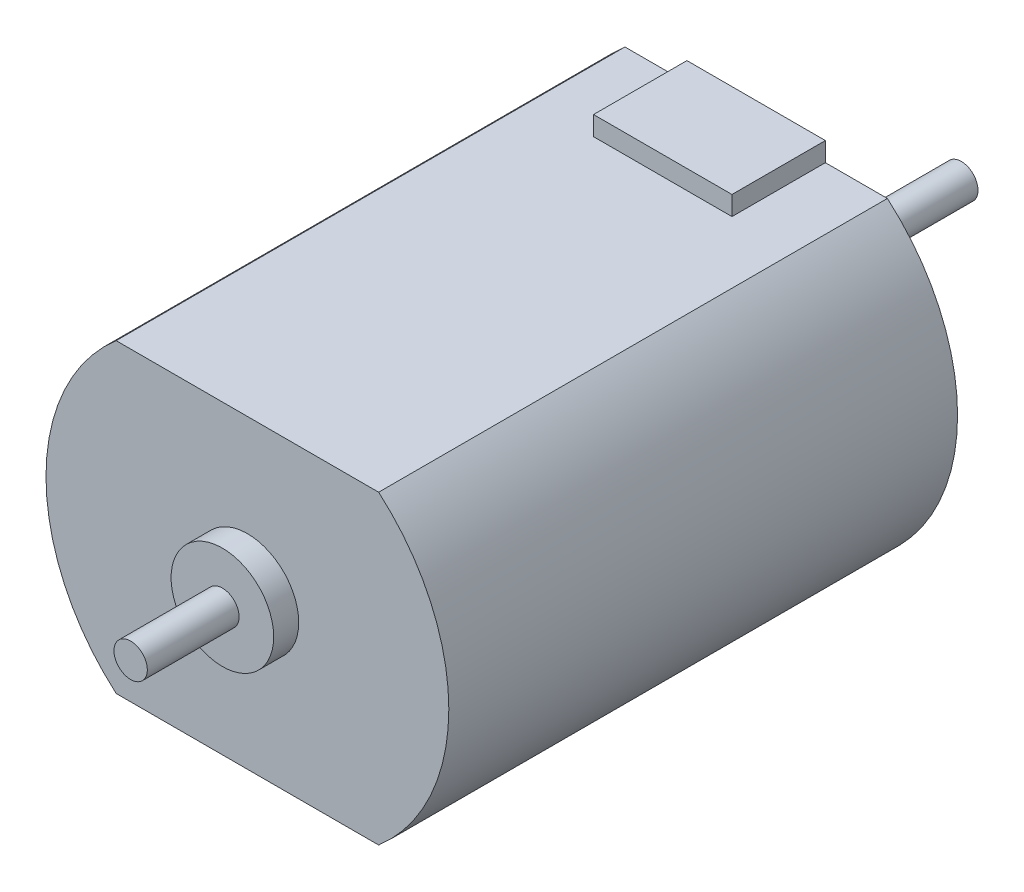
from build123d import *

# Parameters (mm, degrees)
MAIN_BODY_DEPTH          = 30.5
SKETCH2_R                = 4.23
LONG_SHAFT_COLLAR_DEPTH  = 2
SKETCH3_R                = 1
LONG_SHAFT_DEPTH         = 10.3
SKETCH5_W                = 8.3
SKETCH5_H                = 5.6
LEAD_BUMP_DEPTH          = 1.15
SKETCH6_R                = 3.075
SHORT_SHAFT_COLLAR_DEPTH = 1.5
SHORT_START              = 5.5
SKETCH7_R                = 1
SHORT_SHAFT_DEPTH        = 5.5


with BuildPart() as part:
    # Sketch1 → Main Body (new body)
    with BuildSketch(Plane.XY):
        with BuildLine():
            Line((-7.867656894, -9.16), (7.867656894, -9.16))
            ThreePointArc((7.867656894, -9.16), (12.075, 0), (7.867656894, 9.16))
            Line((7.867656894, 9.16), (-7.867656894, 9.16))
            ThreePointArc((-7.867656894, 9.16), (-12.075, 0), (-7.867656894, -9.16))
        make_face()
    extrude(amount=MAIN_BODY_DEPTH)

    # Sketch2 → Long Shaft Collar (add)
    with BuildSketch(Plane(origin=(0, 0, 0), x_dir=(-1, 0, 0), z_dir=(0, 0, -1))):
        Circle(SKETCH2_R)
    extrude(amount=LONG_SHAFT_COLLAR_DEPTH)

    # Sketch3 → Long Shaft (add)
    with BuildSketch(Plane(origin=(0, 0, -2), x_dir=(-1, 0, 0), z_dir=(0, 0, -1))):
        with Locations(Location((0, 0, 0), (0, 0, 180))):
            Circle(SKETCH3_R)
    extrude(amount=LONG_SHAFT_DEPTH)

    # Sketch5 → Lead Bump (add)
    with BuildSketch(Plane(origin=(0, 9.16, 0), x_dir=(1, 0, 0), z_dir=(0, 1, 0))):
        with Locations((0, -2.8)):
            Rectangle(SKETCH5_W, SKETCH5_H)
    extrude(amount=LEAD_BUMP_DEPTH)

    # Sketch6 → Short Shaft Collar (add)
    with BuildSketch(Plane.XY.offset(30.5)):
        Circle(SKETCH6_R)
    extrude(amount=SHORT_SHAFT_COLLAR_DEPTH)

    # Sketch7 → Short shaft (add)
    with BuildSketch(Plane.XY.offset(32).offset(SHORT_START)):
        Circle(SKETCH7_R)
    extrude(amount=-SHORT_SHAFT_DEPTH)


solid = part.part
